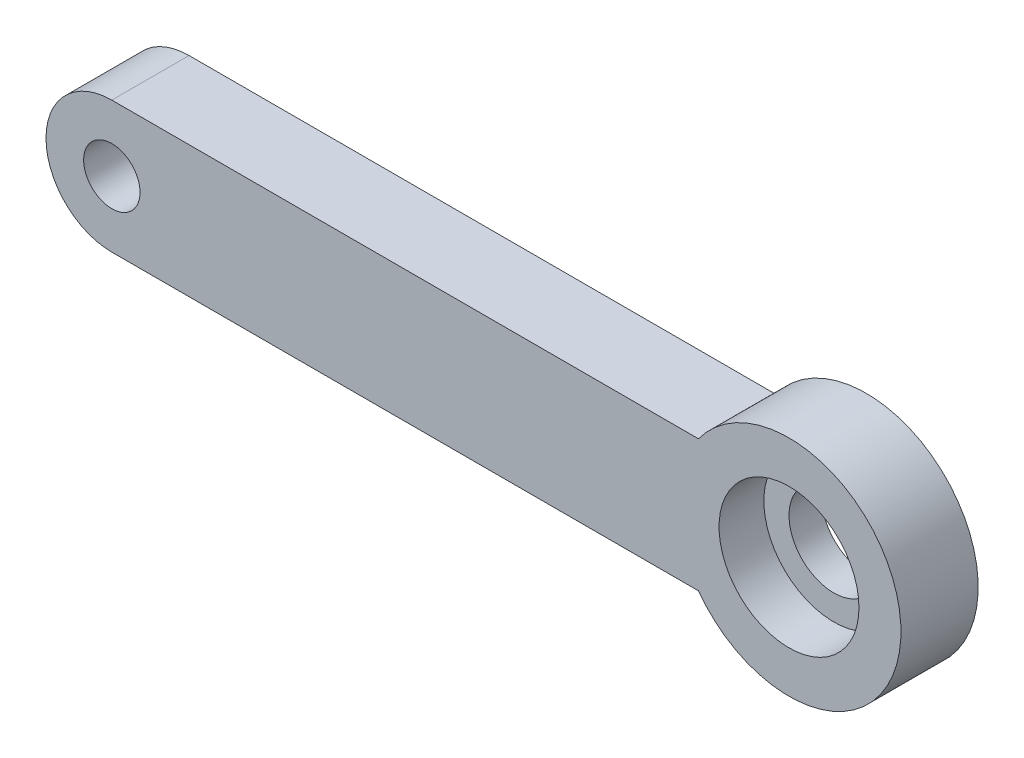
ISO-10303-21;
HEADER;
FILE_DESCRIPTION(('STEP AP214'),'2;1');
FILE_NAME('part.step','',(''),(''),'','','');
FILE_SCHEMA(('AUTOMOTIVE_DESIGN { 1 0 10303 214 1 1 1 1 }'));
ENDSEC;
DATA;
#1=APPLICATION_CONTEXT('core data for automotive mechanical design processes');
#2=APPLICATION_PROTOCOL_DEFINITION('international standard','automotive_design',2000,#1);
#3=PRODUCT_CONTEXT('',#1,'mechanical');
#4=PRODUCT('Part','Part','',(#3));
#5=PRODUCT_RELATED_PRODUCT_CATEGORY('part','',(#4));
#6=PRODUCT_DEFINITION_FORMATION('','',#4);
#7=PRODUCT_DEFINITION_CONTEXT('part definition',#1,'design');
#8=PRODUCT_DEFINITION('design','',#6,#7);
#9=PRODUCT_DEFINITION_SHAPE('','',#8);
#10=(LENGTH_UNIT() NAMED_UNIT(*) SI_UNIT(.MILLI.,.METRE.));
#11=(NAMED_UNIT(*) PLANE_ANGLE_UNIT() SI_UNIT($,.RADIAN.));
#12=(NAMED_UNIT(*) SI_UNIT($,.STERADIAN.) SOLID_ANGLE_UNIT());
#13=UNCERTAINTY_MEASURE_WITH_UNIT(LENGTH_MEASURE(1.E-05),#10,'distance_accuracy_value','');
#14=(GEOMETRIC_REPRESENTATION_CONTEXT(3) GLOBAL_UNCERTAINTY_ASSIGNED_CONTEXT((#13)) GLOBAL_UNIT_ASSIGNED_CONTEXT((#10,
#11,#12)) REPRESENTATION_CONTEXT('',''));
#15=CARTESIAN_POINT('',(0.,0.,0.));
#16=DIRECTION('',(0.,0.,1.));
#17=DIRECTION('',(1.,0.,0.));
#18=AXIS2_PLACEMENT_3D('',#15,#16,#17);
#19=CARTESIAN_POINT('',(0.,0.,8.763));
#20=DIRECTION('',(0.,0.,-1.));
#21=DIRECTION('',(-1.,0.,0.));
#22=AXIS2_PLACEMENT_3D('',#19,#20,#21);
#23=CYLINDRICAL_SURFACE('',#22,5.08);
#24=CARTESIAN_POINT('',(0.,0.,0.));
#25=DIRECTION('',(0.,0.,1.));
#26=DIRECTION('',(1.,0.,0.));
#27=AXIS2_PLACEMENT_3D('',#24,#25,#26);
#28=CIRCLE('',#27,5.08);
#29=CARTESIAN_POINT('',(5.08,0.,0.));
#30=VERTEX_POINT('',#29);
#31=EDGE_CURVE('E102',#30,#30,#28,.T.);
#32=ORIENTED_EDGE('',*,*,#31,.F.);
#33=EDGE_LOOP('',(#32));
#34=FACE_BOUND('',#33,.T.);
#35=CARTESIAN_POINT('',(0.,0.,3.683));
#36=DIRECTION('',(0.,0.,1.));
#37=DIRECTION('',(1.,0.,0.));
#38=AXIS2_PLACEMENT_3D('',#35,#36,#37);
#39=CIRCLE('',#38,5.08);
#40=CARTESIAN_POINT('',(5.08,0.,3.683));
#41=VERTEX_POINT('',#40);
#42=EDGE_CURVE('E36',#41,#41,#39,.T.);
#43=ORIENTED_EDGE('',*,*,#42,.T.);
#44=EDGE_LOOP('',(#43));
#45=FACE_BOUND('',#44,.T.);
#46=ADVANCED_FACE('F32',(#34,#45),#23,.F.);
#47=CARTESIAN_POINT('',(-76.835,0.,8.763));
#48=DIRECTION('',(0.,0.,-1.));
#49=DIRECTION('',(-1.,0.,0.));
#50=AXIS2_PLACEMENT_3D('',#47,#48,#49);
#51=PLANE('',#50);
#52=CARTESIAN_POINT('',(0.,0.,8.763));
#53=DIRECTION('',(0.,0.,1.));
#54=DIRECTION('',(1.,0.,0.));
#55=AXIS2_PLACEMENT_3D('',#52,#53,#54);
#56=CIRCLE('',#55,7.9375);
#57=CARTESIAN_POINT('',(7.9375,0.,8.763));
#58=VERTEX_POINT('',#57);
#59=EDGE_CURVE('E122',#58,#58,#56,.T.);
#60=ORIENTED_EDGE('',*,*,#59,.F.);
#61=EDGE_LOOP('',(#60));
#62=FACE_BOUND('',#61,.T.);
#63=CARTESIAN_POINT('',(-76.835,0.,8.763));
#64=DIRECTION('',(0.,0.,1.));
#65=DIRECTION('',(-1.,0.,0.));
#66=AXIS2_PLACEMENT_3D('',#63,#64,#65);
#67=CIRCLE('',#66,7.47004794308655);
#68=CARTESIAN_POINT('',(-76.835,7.47004794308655,8.763));
#69=VERTEX_POINT('',#68);
#70=CARTESIAN_POINT('',(-76.835,-7.47004794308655,8.763));
#71=VERTEX_POINT('',#70);
#72=EDGE_CURVE('E86',#69,#71,#67,.T.);
#73=ORIENTED_EDGE('',*,*,#72,.T.);
#74=DIRECTION('',(1.,0.,0.));
#75=VECTOR('',#74,1.);
#76=CARTESIAN_POINT('',(-76.835,-7.47004794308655,8.763));
#77=LINE('',#76,#75);
#78=CARTESIAN_POINT('',(-10.2707538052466,-7.47004794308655,8.763));
#79=VERTEX_POINT('',#78);
#80=EDGE_CURVE('E80',#71,#79,#77,.T.);
#81=ORIENTED_EDGE('',*,*,#80,.T.);
#82=CARTESIAN_POINT('',(0.,0.,8.763));
#83=DIRECTION('',(0.,0.,1.));
#84=DIRECTION('',(-1.,0.,0.));
#85=AXIS2_PLACEMENT_3D('',#82,#83,#84);
#86=CIRCLE('',#85,12.7);
#87=CARTESIAN_POINT('',(-10.2707538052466,7.47004794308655,8.763));
#88=VERTEX_POINT('',#87);
#89=EDGE_CURVE('E84',#79,#88,#86,.T.);
#90=ORIENTED_EDGE('',*,*,#89,.T.);
#91=DIRECTION('',(-1.,0.,0.));
#92=VECTOR('',#91,1.);
#93=CARTESIAN_POINT('',(-76.835,7.47004794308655,8.763));
#94=LINE('',#93,#92);
#95=EDGE_CURVE('E50',#88,#69,#94,.T.);
#96=ORIENTED_EDGE('',*,*,#95,.T.);
#97=EDGE_LOOP('',(#73,#81,#90,#96));
#98=FACE_BOUND('',#97,.T.);
#99=CARTESIAN_POINT('',(-76.835,0.,8.763));
#100=DIRECTION('',(0.,0.,1.));
#101=DIRECTION('',(1.,0.,0.));
#102=AXIS2_PLACEMENT_3D('',#99,#100,#101);
#103=CIRCLE('',#102,3.2004);
#104=CARTESIAN_POINT('',(-73.6346,0.,8.763));
#105=VERTEX_POINT('',#104);
#106=EDGE_CURVE('E116',#105,#105,#103,.T.);
#107=ORIENTED_EDGE('',*,*,#106,.F.);
#108=EDGE_LOOP('',(#107));
#109=FACE_BOUND('',#108,.T.);
#110=ADVANCED_FACE('F81',(#62,#98,#109),#51,.F.);
#111=CARTESIAN_POINT('',(-76.835,0.,0.));
#112=DIRECTION('',(0.,0.,-1.));
#113=DIRECTION('',(-1.,0.,0.));
#114=AXIS2_PLACEMENT_3D('',#111,#112,#113);
#115=PLANE('',#114);
#116=ORIENTED_EDGE('',*,*,#31,.T.);
#117=EDGE_LOOP('',(#116));
#118=FACE_BOUND('',#117,.T.);
#119=CARTESIAN_POINT('',(-76.835,0.,0.));
#120=DIRECTION('',(0.,0.,1.));
#121=DIRECTION('',(-1.,0.,0.));
#122=AXIS2_PLACEMENT_3D('',#119,#120,#121);
#123=CIRCLE('',#122,7.47004794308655);
#124=CARTESIAN_POINT('',(-76.835,7.47004794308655,0.));
#125=VERTEX_POINT('',#124);
#126=CARTESIAN_POINT('',(-76.835,-7.47004794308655,0.));
#127=VERTEX_POINT('',#126);
#128=EDGE_CURVE('E99',#125,#127,#123,.T.);
#129=ORIENTED_EDGE('',*,*,#128,.F.);
#130=DIRECTION('',(-1.,0.,0.));
#131=VECTOR('',#130,1.);
#132=CARTESIAN_POINT('',(-76.835,7.47004794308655,0.));
#133=LINE('',#132,#131);
#134=CARTESIAN_POINT('',(-10.2707538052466,7.47004794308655,0.));
#135=VERTEX_POINT('',#134);
#136=EDGE_CURVE('E73',#135,#125,#133,.T.);
#137=ORIENTED_EDGE('',*,*,#136,.F.);
#138=CARTESIAN_POINT('',(0.,0.,0.));
#139=DIRECTION('',(0.,0.,1.));
#140=DIRECTION('',(-1.,0.,0.));
#141=AXIS2_PLACEMENT_3D('',#138,#139,#140);
#142=CIRCLE('',#141,12.7);
#143=CARTESIAN_POINT('',(-10.2707538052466,-7.47004794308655,0.));
#144=VERTEX_POINT('',#143);
#145=EDGE_CURVE('E67',#144,#135,#142,.T.);
#146=ORIENTED_EDGE('',*,*,#145,.F.);
#147=DIRECTION('',(1.,0.,0.));
#148=VECTOR('',#147,1.);
#149=CARTESIAN_POINT('',(-76.835,-7.47004794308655,0.));
#150=LINE('',#149,#148);
#151=EDGE_CURVE('E90',#127,#144,#150,.T.);
#152=ORIENTED_EDGE('',*,*,#151,.F.);
#153=EDGE_LOOP('',(#129,#137,#146,#152));
#154=FACE_BOUND('',#153,.T.);
#155=CARTESIAN_POINT('',(-76.835,0.,0.));
#156=DIRECTION('',(0.,0.,1.));
#157=DIRECTION('',(1.,0.,0.));
#158=AXIS2_PLACEMENT_3D('',#155,#156,#157);
#159=CIRCLE('',#158,3.2004);
#160=CARTESIAN_POINT('',(-73.6346,0.,0.));
#161=VERTEX_POINT('',#160);
#162=EDGE_CURVE('E117',#161,#161,#159,.T.);
#163=ORIENTED_EDGE('',*,*,#162,.T.);
#164=EDGE_LOOP('',(#163));
#165=FACE_BOUND('',#164,.T.);
#166=ADVANCED_FACE('F110',(#118,#154,#165),#115,.T.);
#167=CARTESIAN_POINT('',(-76.835,0.,8.763));
#168=DIRECTION('',(0.,0.,-1.));
#169=DIRECTION('',(-1.,0.,0.));
#170=AXIS2_PLACEMENT_3D('',#167,#168,#169);
#171=CYLINDRICAL_SURFACE('',#170,7.47004794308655);
#172=ORIENTED_EDGE('',*,*,#128,.T.);
#173=DIRECTION('',(0.,0.,-1.));
#174=VECTOR('',#173,1.);
#175=CARTESIAN_POINT('',(-76.835,-7.47004794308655,8.763));
#176=LINE('',#175,#174);
#177=EDGE_CURVE('E11',#71,#127,#176,.T.);
#178=ORIENTED_EDGE('',*,*,#177,.F.);
#179=ORIENTED_EDGE('',*,*,#72,.F.);
#180=DIRECTION('',(0.,0.,-1.));
#181=VECTOR('',#180,1.);
#182=CARTESIAN_POINT('',(-76.835,7.47004794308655,8.763));
#183=LINE('',#182,#181);
#184=EDGE_CURVE('E95',#69,#125,#183,.T.);
#185=ORIENTED_EDGE('',*,*,#184,.T.);
#186=EDGE_LOOP('',(#172,#178,#179,#185));
#187=FACE_BOUND('',#186,.T.);
#188=ADVANCED_FACE('F34',(#187),#171,.T.);
#189=CARTESIAN_POINT('',(-76.835,-7.47004794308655,8.763));
#190=DIRECTION('',(0.,1.,0.));
#191=DIRECTION('',(0.,0.,1.));
#192=AXIS2_PLACEMENT_3D('',#189,#190,#191);
#193=PLANE('',#192);
#194=ORIENTED_EDGE('',*,*,#151,.T.);
#195=DIRECTION('',(0.,0.,-1.));
#196=VECTOR('',#195,1.);
#197=CARTESIAN_POINT('',(-10.2707538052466,-7.47004794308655,8.763));
#198=LINE('',#197,#196);
#199=EDGE_CURVE('E42',#79,#144,#198,.T.);
#200=ORIENTED_EDGE('',*,*,#199,.F.);
#201=ORIENTED_EDGE('',*,*,#80,.F.);
#202=ORIENTED_EDGE('',*,*,#177,.T.);
#203=EDGE_LOOP('',(#194,#200,#201,#202));
#204=FACE_BOUND('',#203,.T.);
#205=ADVANCED_FACE('F89',(#204),#193,.F.);
#206=CARTESIAN_POINT('',(0.,0.,8.763));
#207=DIRECTION('',(0.,0.,-1.));
#208=DIRECTION('',(-1.,0.,0.));
#209=AXIS2_PLACEMENT_3D('',#206,#207,#208);
#210=CYLINDRICAL_SURFACE('',#209,12.7);
#211=ORIENTED_EDGE('',*,*,#145,.T.);
#212=DIRECTION('',(0.,0.,-1.));
#213=VECTOR('',#212,1.);
#214=CARTESIAN_POINT('',(-10.2707538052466,7.47004794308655,8.763));
#215=LINE('',#214,#213);
#216=EDGE_CURVE('E91',#88,#135,#215,.T.);
#217=ORIENTED_EDGE('',*,*,#216,.F.);
#218=ORIENTED_EDGE('',*,*,#89,.F.);
#219=ORIENTED_EDGE('',*,*,#199,.T.);
#220=EDGE_LOOP('',(#211,#217,#218,#219));
#221=FACE_BOUND('',#220,.T.);
#222=ADVANCED_FACE('F93',(#221),#210,.T.);
#223=CARTESIAN_POINT('',(-76.835,7.47004794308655,8.763));
#224=DIRECTION('',(0.,-1.,0.));
#225=DIRECTION('',(0.,0.,-1.));
#226=AXIS2_PLACEMENT_3D('',#223,#224,#225);
#227=PLANE('',#226);
#228=ORIENTED_EDGE('',*,*,#136,.T.);
#229=ORIENTED_EDGE('',*,*,#184,.F.);
#230=ORIENTED_EDGE('',*,*,#95,.F.);
#231=ORIENTED_EDGE('',*,*,#216,.T.);
#232=EDGE_LOOP('',(#228,#229,#230,#231));
#233=FACE_BOUND('',#232,.T.);
#234=ADVANCED_FACE('F107',(#233),#227,.F.);
#235=CARTESIAN_POINT('',(-76.835,0.,8.763));
#236=DIRECTION('',(0.,0.,-1.));
#237=DIRECTION('',(-1.,0.,0.));
#238=AXIS2_PLACEMENT_3D('',#235,#236,#237);
#239=CYLINDRICAL_SURFACE('',#238,3.2004);
#240=ORIENTED_EDGE('',*,*,#106,.T.);
#241=EDGE_LOOP('',(#240));
#242=FACE_BOUND('',#241,.T.);
#243=ORIENTED_EDGE('',*,*,#162,.F.);
#244=EDGE_LOOP('',(#243));
#245=FACE_BOUND('',#244,.T.);
#246=ADVANCED_FACE('F140',(#242,#245),#239,.F.);
#247=CARTESIAN_POINT('',(0.,0.,3.683));
#248=DIRECTION('',(0.,0.,1.));
#249=DIRECTION('',(1.,0.,0.));
#250=AXIS2_PLACEMENT_3D('',#247,#248,#249);
#251=CYLINDRICAL_SURFACE('',#250,7.9375);
#252=CARTESIAN_POINT('',(0.,0.,3.683));
#253=DIRECTION('',(0.,0.,1.));
#254=DIRECTION('',(1.,0.,0.));
#255=AXIS2_PLACEMENT_3D('',#252,#253,#254);
#256=CIRCLE('',#255,7.9375);
#257=CARTESIAN_POINT('',(7.9375,0.,3.683));
#258=VERTEX_POINT('',#257);
#259=EDGE_CURVE('E125',#258,#258,#256,.T.);
#260=ORIENTED_EDGE('',*,*,#259,.F.);
#261=EDGE_LOOP('',(#260));
#262=FACE_BOUND('',#261,.T.);
#263=ORIENTED_EDGE('',*,*,#59,.T.);
#264=EDGE_LOOP('',(#263));
#265=FACE_BOUND('',#264,.T.);
#266=ADVANCED_FACE('F135',(#262,#265),#251,.F.);
#267=CARTESIAN_POINT('',(0.,0.,3.683));
#268=DIRECTION('',(0.,0.,1.));
#269=DIRECTION('',(1.,0.,0.));
#270=AXIS2_PLACEMENT_3D('',#267,#268,#269);
#271=PLANE('',#270);
#272=ORIENTED_EDGE('',*,*,#42,.F.);
#273=EDGE_LOOP('',(#272));
#274=FACE_BOUND('',#273,.T.);
#275=ORIENTED_EDGE('',*,*,#259,.T.);
#276=EDGE_LOOP('',(#275));
#277=FACE_BOUND('',#276,.T.);
#278=ADVANCED_FACE('F133',(#274,#277),#271,.T.);
#279=CLOSED_SHELL('',(#46,#110,#166,#188,#205,#222,#234,#246,#266,#278));
#280=MANIFOLD_SOLID_BREP('B2',#279);
#281=ADVANCED_BREP_SHAPE_REPRESENTATION('',(#18,#280),#14);
#282=SHAPE_DEFINITION_REPRESENTATION(#9,#281);
ENDSEC;
END-ISO-10303-21;
